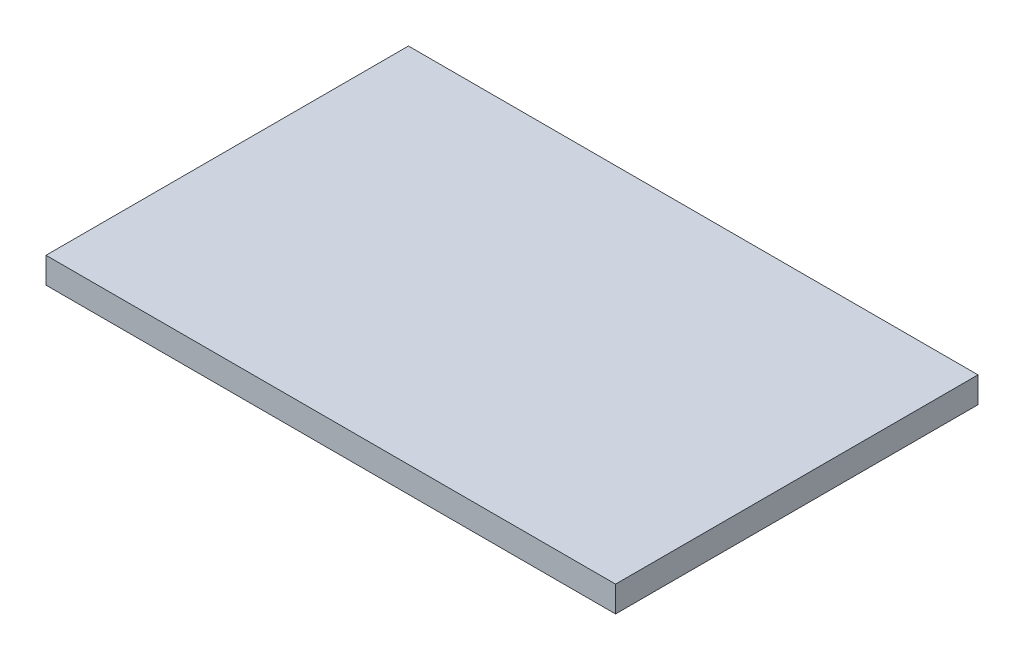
ISO-10303-21;
HEADER;
FILE_DESCRIPTION(('STEP AP214'),'2;1');
FILE_NAME('part.step','',(''),(''),'','','');
FILE_SCHEMA(('AUTOMOTIVE_DESIGN { 1 0 10303 214 1 1 1 1 }'));
ENDSEC;
DATA;
#1=APPLICATION_CONTEXT('core data for automotive mechanical design processes');
#2=APPLICATION_PROTOCOL_DEFINITION('international standard','automotive_design',2000,#1);
#3=PRODUCT_CONTEXT('',#1,'mechanical');
#4=PRODUCT('Part','Part','',(#3));
#5=PRODUCT_RELATED_PRODUCT_CATEGORY('part','',(#4));
#6=PRODUCT_DEFINITION_FORMATION('','',#4);
#7=PRODUCT_DEFINITION_CONTEXT('part definition',#1,'design');
#8=PRODUCT_DEFINITION('design','',#6,#7);
#9=PRODUCT_DEFINITION_SHAPE('','',#8);
#10=(LENGTH_UNIT() NAMED_UNIT(*) SI_UNIT(.MILLI.,.METRE.));
#11=(NAMED_UNIT(*) PLANE_ANGLE_UNIT() SI_UNIT($,.RADIAN.));
#12=(NAMED_UNIT(*) SI_UNIT($,.STERADIAN.) SOLID_ANGLE_UNIT());
#13=UNCERTAINTY_MEASURE_WITH_UNIT(LENGTH_MEASURE(1.E-05),#10,'distance_accuracy_value','');
#14=(GEOMETRIC_REPRESENTATION_CONTEXT(3) GLOBAL_UNCERTAINTY_ASSIGNED_CONTEXT((#13)) GLOBAL_UNIT_ASSIGNED_CONTEXT((#10,
#11,#12)) REPRESENTATION_CONTEXT('',''));
#15=CARTESIAN_POINT('',(0.,0.,0.));
#16=DIRECTION('',(0.,0.,1.));
#17=DIRECTION('',(1.,0.,0.));
#18=AXIS2_PLACEMENT_3D('',#15,#16,#17);
#19=CARTESIAN_POINT('',(-55.,5.,35.));
#20=DIRECTION('',(1.,0.,0.));
#21=DIRECTION('',(0.,0.,-1.));
#22=AXIS2_PLACEMENT_3D('',#19,#20,#21);
#23=PLANE('',#22);
#24=DIRECTION('',(0.,0.,1.));
#25=VECTOR('',#24,1.);
#26=CARTESIAN_POINT('',(-55.,0.,35.));
#27=LINE('',#26,#25);
#28=CARTESIAN_POINT('',(-55.,0.,-35.));
#29=VERTEX_POINT('',#28);
#30=CARTESIAN_POINT('',(-55.,0.,35.));
#31=VERTEX_POINT('',#30);
#32=EDGE_CURVE('E98',#29,#31,#27,.T.);
#33=ORIENTED_EDGE('',*,*,#32,.T.);
#34=DIRECTION('',(0.,-1.,0.));
#35=VECTOR('',#34,1.);
#36=CARTESIAN_POINT('',(-55.,5.,35.));
#37=LINE('',#36,#35);
#38=CARTESIAN_POINT('',(-55.,5.,35.));
#39=VERTEX_POINT('',#38);
#40=EDGE_CURVE('E11',#39,#31,#37,.T.);
#41=ORIENTED_EDGE('',*,*,#40,.F.);
#42=DIRECTION('',(0.,0.,1.));
#43=VECTOR('',#42,1.);
#44=CARTESIAN_POINT('',(-55.,5.,35.));
#45=LINE('',#44,#43);
#46=CARTESIAN_POINT('',(-55.,5.,-35.));
#47=VERTEX_POINT('',#46);
#48=EDGE_CURVE('E86',#47,#39,#45,.T.);
#49=ORIENTED_EDGE('',*,*,#48,.F.);
#50=DIRECTION('',(0.,-1.,0.));
#51=VECTOR('',#50,1.);
#52=CARTESIAN_POINT('',(-55.,5.,-35.));
#53=LINE('',#52,#51);
#54=EDGE_CURVE('E94',#47,#29,#53,.T.);
#55=ORIENTED_EDGE('',*,*,#54,.T.);
#56=EDGE_LOOP('',(#33,#41,#49,#55));
#57=FACE_BOUND('',#56,.T.);
#58=ADVANCED_FACE('F35',(#57),#23,.F.);
#59=CARTESIAN_POINT('',(55.,5.,35.));
#60=DIRECTION('',(0.,0.,-1.));
#61=DIRECTION('',(-1.,0.,0.));
#62=AXIS2_PLACEMENT_3D('',#59,#60,#61);
#63=PLANE('',#62);
#64=DIRECTION('',(1.,0.,0.));
#65=VECTOR('',#64,1.);
#66=CARTESIAN_POINT('',(55.,0.,35.));
#67=LINE('',#66,#65);
#68=CARTESIAN_POINT('',(55.,0.,35.));
#69=VERTEX_POINT('',#68);
#70=EDGE_CURVE('E90',#31,#69,#67,.T.);
#71=ORIENTED_EDGE('',*,*,#70,.T.);
#72=DIRECTION('',(0.,-1.,0.));
#73=VECTOR('',#72,1.);
#74=CARTESIAN_POINT('',(55.,5.,35.));
#75=LINE('',#74,#73);
#76=CARTESIAN_POINT('',(55.,5.,35.));
#77=VERTEX_POINT('',#76);
#78=EDGE_CURVE('E43',#77,#69,#75,.T.);
#79=ORIENTED_EDGE('',*,*,#78,.F.);
#80=DIRECTION('',(1.,0.,0.));
#81=VECTOR('',#80,1.);
#82=CARTESIAN_POINT('',(55.,5.,35.));
#83=LINE('',#82,#81);
#84=EDGE_CURVE('E81',#39,#77,#83,.T.);
#85=ORIENTED_EDGE('',*,*,#84,.F.);
#86=ORIENTED_EDGE('',*,*,#40,.T.);
#87=EDGE_LOOP('',(#71,#79,#85,#86));
#88=FACE_BOUND('',#87,.T.);
#89=ADVANCED_FACE('F89',(#88),#63,.F.);
#90=CARTESIAN_POINT('',(55.,5.,35.));
#91=DIRECTION('',(-1.,0.,0.));
#92=DIRECTION('',(0.,0.,1.));
#93=AXIS2_PLACEMENT_3D('',#90,#91,#92);
#94=PLANE('',#93);
#95=DIRECTION('',(0.,0.,-1.));
#96=VECTOR('',#95,1.);
#97=CARTESIAN_POINT('',(55.,0.,35.));
#98=LINE('',#97,#96);
#99=CARTESIAN_POINT('',(55.,0.,-35.));
#100=VERTEX_POINT('',#99);
#101=EDGE_CURVE('E68',#69,#100,#98,.T.);
#102=ORIENTED_EDGE('',*,*,#101,.T.);
#103=DIRECTION('',(0.,-1.,0.));
#104=VECTOR('',#103,1.);
#105=CARTESIAN_POINT('',(55.,5.,-35.));
#106=LINE('',#105,#104);
#107=CARTESIAN_POINT('',(55.,5.,-35.));
#108=VERTEX_POINT('',#107);
#109=EDGE_CURVE('E91',#108,#100,#106,.T.);
#110=ORIENTED_EDGE('',*,*,#109,.F.);
#111=DIRECTION('',(0.,0.,-1.));
#112=VECTOR('',#111,1.);
#113=CARTESIAN_POINT('',(55.,5.,35.));
#114=LINE('',#113,#112);
#115=EDGE_CURVE('E84',#77,#108,#114,.T.);
#116=ORIENTED_EDGE('',*,*,#115,.F.);
#117=ORIENTED_EDGE('',*,*,#78,.T.);
#118=EDGE_LOOP('',(#102,#110,#116,#117));
#119=FACE_BOUND('',#118,.T.);
#120=ADVANCED_FACE('F92',(#119),#94,.F.);
#121=CARTESIAN_POINT('',(55.,5.,-35.));
#122=DIRECTION('',(0.,0.,1.));
#123=DIRECTION('',(1.,0.,0.));
#124=AXIS2_PLACEMENT_3D('',#121,#122,#123);
#125=PLANE('',#124);
#126=DIRECTION('',(-1.,0.,0.));
#127=VECTOR('',#126,1.);
#128=CARTESIAN_POINT('',(55.,0.,-35.));
#129=LINE('',#128,#127);
#130=EDGE_CURVE('E74',#100,#29,#129,.T.);
#131=ORIENTED_EDGE('',*,*,#130,.T.);
#132=ORIENTED_EDGE('',*,*,#54,.F.);
#133=DIRECTION('',(-1.,0.,0.));
#134=VECTOR('',#133,1.);
#135=CARTESIAN_POINT('',(55.,5.,-35.));
#136=LINE('',#135,#134);
#137=EDGE_CURVE('E51',#108,#47,#136,.T.);
#138=ORIENTED_EDGE('',*,*,#137,.F.);
#139=ORIENTED_EDGE('',*,*,#109,.T.);
#140=EDGE_LOOP('',(#131,#132,#138,#139));
#141=FACE_BOUND('',#140,.T.);
#142=ADVANCED_FACE('F105',(#141),#125,.F.);
#143=CARTESIAN_POINT('',(0.,5.,0.));
#144=DIRECTION('',(0.,1.,0.));
#145=DIRECTION('',(0.,0.,1.));
#146=AXIS2_PLACEMENT_3D('',#143,#144,#145);
#147=PLANE('',#146);
#148=ORIENTED_EDGE('',*,*,#48,.T.);
#149=ORIENTED_EDGE('',*,*,#84,.T.);
#150=ORIENTED_EDGE('',*,*,#115,.T.);
#151=ORIENTED_EDGE('',*,*,#137,.T.);
#152=EDGE_LOOP('',(#148,#149,#150,#151));
#153=FACE_BOUND('',#152,.T.);
#154=ADVANCED_FACE('F82',(#153),#147,.T.);
#155=CARTESIAN_POINT('',(0.,0.,0.));
#156=DIRECTION('',(0.,1.,0.));
#157=DIRECTION('',(0.,0.,1.));
#158=AXIS2_PLACEMENT_3D('',#155,#156,#157);
#159=PLANE('',#158);
#160=ORIENTED_EDGE('',*,*,#32,.F.);
#161=ORIENTED_EDGE('',*,*,#130,.F.);
#162=ORIENTED_EDGE('',*,*,#101,.F.);
#163=ORIENTED_EDGE('',*,*,#70,.F.);
#164=EDGE_LOOP('',(#160,#161,#162,#163));
#165=FACE_BOUND('',#164,.T.);
#166=ADVANCED_FACE('F108',(#165),#159,.F.);
#167=CLOSED_SHELL('',(#58,#89,#120,#142,#154,#166));
#168=MANIFOLD_SOLID_BREP('B2',#167);
#169=ADVANCED_BREP_SHAPE_REPRESENTATION('',(#18,#168),#14);
#170=SHAPE_DEFINITION_REPRESENTATION(#9,#169);
ENDSEC;
END-ISO-10303-21;
